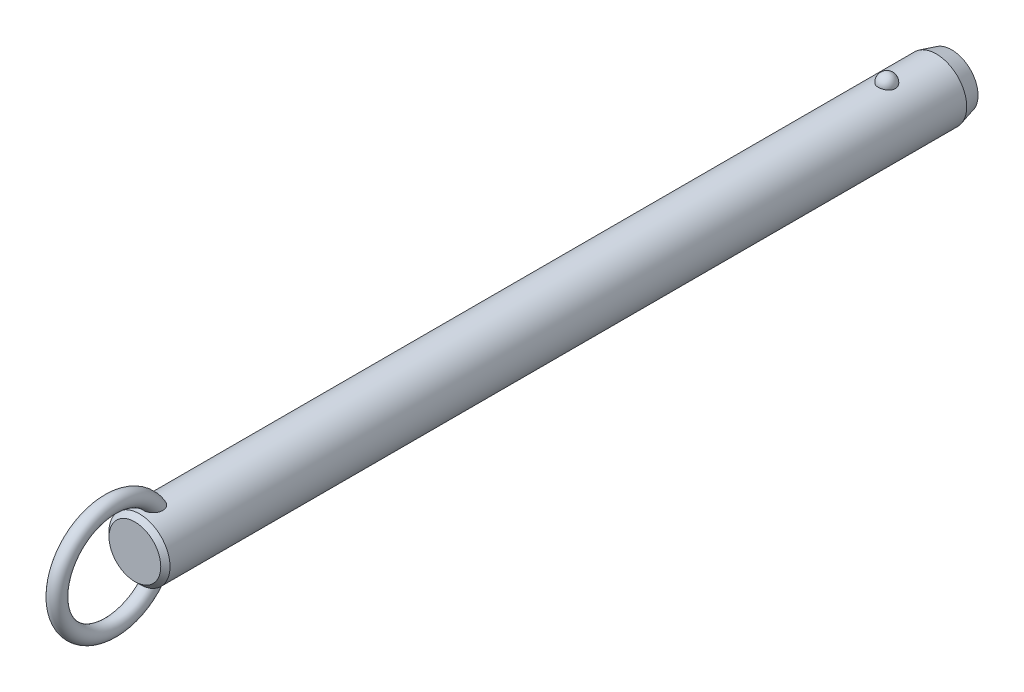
ISO-10303-21;
HEADER;
FILE_DESCRIPTION(('STEP AP214'),'2;1');
FILE_NAME('part.step','',(''),(''),'','','');
FILE_SCHEMA(('AUTOMOTIVE_DESIGN { 1 0 10303 214 1 1 1 1 }'));
ENDSEC;
DATA;
#1=APPLICATION_CONTEXT('core data for automotive mechanical design processes');
#2=APPLICATION_PROTOCOL_DEFINITION('international standard','automotive_design',2000,#1);
#3=PRODUCT_CONTEXT('',#1,'mechanical');
#4=PRODUCT('Part','Part','',(#3));
#5=PRODUCT_RELATED_PRODUCT_CATEGORY('part','',(#4));
#6=PRODUCT_DEFINITION_FORMATION('','',#4);
#7=PRODUCT_DEFINITION_CONTEXT('part definition',#1,'design');
#8=PRODUCT_DEFINITION('design','',#6,#7);
#9=PRODUCT_DEFINITION_SHAPE('','',#8);
#10=(LENGTH_UNIT() NAMED_UNIT(*) SI_UNIT(.MILLI.,.METRE.));
#11=(NAMED_UNIT(*) PLANE_ANGLE_UNIT() SI_UNIT($,.RADIAN.));
#12=(NAMED_UNIT(*) SI_UNIT($,.STERADIAN.) SOLID_ANGLE_UNIT());
#13=UNCERTAINTY_MEASURE_WITH_UNIT(LENGTH_MEASURE(1.E-05),#10,'distance_accuracy_value','');
#14=(GEOMETRIC_REPRESENTATION_CONTEXT(3) GLOBAL_UNCERTAINTY_ASSIGNED_CONTEXT((#13)) GLOBAL_UNIT_ASSIGNED_CONTEXT((#10,
#11,#12)) REPRESENTATION_CONTEXT('',''));
#15=CARTESIAN_POINT('',(0.,0.,0.));
#16=DIRECTION('',(0.,0.,1.));
#17=DIRECTION('',(1.,0.,0.));
#18=AXIS2_PLACEMENT_3D('',#15,#16,#17);
#19=CARTESIAN_POINT('',(0.,0.,182.9));
#20=DIRECTION('',(0.,0.,-1.));
#21=DIRECTION('',(-1.,0.,0.));
#22=AXIS2_PLACEMENT_3D('',#19,#20,#21);
#23=CYLINDRICAL_SURFACE('',#22,7.9);
#24=CARTESIAN_POINT('',(2.1785689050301,7.59367088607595,-2.20000000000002));
#25=CARTESIAN_POINT('',(2.17856679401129,7.59367269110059,-2.07701843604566));
#26=CARTESIAN_POINT('',(2.16853481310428,7.59657145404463,-1.95401006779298));
#27=CARTESIAN_POINT('',(2.12864689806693,7.607843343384,-1.71147811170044));
#28=CARTESIAN_POINT('',(2.09878338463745,7.61621856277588,-1.5919558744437));
#29=CARTESIAN_POINT('',(2.0199931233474,7.63749180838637,-1.35985638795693));
#30=CARTESIAN_POINT('',(1.97107475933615,7.6503878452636,-1.24727610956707));
#31=CARTESIAN_POINT('',(1.85539377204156,7.67926115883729,-1.03213234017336));
#32=CARTESIAN_POINT('',(1.78863158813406,7.69523835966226,-0.929568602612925));
#33=CARTESIAN_POINT('',(1.63856494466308,7.7285848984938,-0.73678633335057));
#34=CARTESIAN_POINT('',(1.55518140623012,7.7459606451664,-0.646630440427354));
#35=CARTESIAN_POINT('',(1.37422937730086,7.78009978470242,-0.481747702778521));
#36=CARTESIAN_POINT('',(1.27666086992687,7.79686317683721,-0.407020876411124));
#37=CARTESIAN_POINT('',(1.07024728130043,7.82786153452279,-0.275278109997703));
#38=CARTESIAN_POINT('',(0.961434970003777,7.84210353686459,-0.218212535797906));
#39=CARTESIAN_POINT('',(0.735351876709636,7.86652194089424,-0.123146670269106));
#40=CARTESIAN_POINT('',(0.618082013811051,7.87669878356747,-0.0851443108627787));
#41=CARTESIAN_POINT('',(0.380637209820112,7.89170521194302,-0.0298158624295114));
#42=CARTESIAN_POINT('',(0.260550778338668,7.89662650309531,-0.0121347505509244));
#43=CARTESIAN_POINT('',(0.0190117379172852,7.90090003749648,0.00324379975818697));
#44=CARTESIAN_POINT('',(-0.102440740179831,7.90025280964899,0.000943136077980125));
#45=CARTESIAN_POINT('',(-0.341452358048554,7.89351056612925,-0.0233955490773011));
#46=CARTESIAN_POINT('',(-0.459042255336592,7.88749257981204,-0.0451545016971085));
#47=CARTESIAN_POINT('',(-0.688796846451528,7.87075812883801,-0.107408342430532));
#48=CARTESIAN_POINT('',(-0.800961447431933,7.86004158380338,-0.14790355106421));
#49=CARTESIAN_POINT('',(-1.01743634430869,7.83497131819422,-0.246799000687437));
#50=CARTESIAN_POINT('',(-1.12169791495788,7.82059709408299,-0.305300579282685));
#51=CARTESIAN_POINT('',(-1.31891765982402,7.78976470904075,-0.43854939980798));
#52=CARTESIAN_POINT('',(-1.41187469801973,7.77330633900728,-0.513298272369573));
#53=CARTESIAN_POINT('',(-1.58577142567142,7.73972434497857,-0.678622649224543));
#54=CARTESIAN_POINT('',(-1.66645140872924,7.72259402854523,-0.769470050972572));
#55=CARTESIAN_POINT('',(-1.81161503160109,7.68983776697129,-0.963538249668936));
#56=CARTESIAN_POINT('',(-1.87609753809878,7.6742119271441,-1.0667599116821));
#57=CARTESIAN_POINT('',(-1.98790138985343,7.6460202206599,-1.28401170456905));
#58=CARTESIAN_POINT('',(-2.03501994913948,7.63349104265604,-1.39815107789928));
#59=CARTESIAN_POINT('',(-2.10986724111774,7.6131449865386,-1.6330178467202));
#60=CARTESIAN_POINT('',(-2.1375965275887,7.60532797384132,-1.75374505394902));
#61=CARTESIAN_POINT('',(-2.17289256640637,7.5953195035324,-1.99782562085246));
#62=CARTESIAN_POINT('',(-2.18054294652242,7.59310471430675,-2.12116592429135));
#63=CARTESIAN_POINT('',(-2.17572919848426,7.59448538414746,-2.36741799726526));
#64=CARTESIAN_POINT('',(-2.1632656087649,7.59808068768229,-2.49032977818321));
#65=CARTESIAN_POINT('',(-2.11865035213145,7.61064035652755,-2.73161015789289));
#66=CARTESIAN_POINT('',(-2.08659579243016,7.61957823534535,-2.84999812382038));
#67=CARTESIAN_POINT('',(-2.00367799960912,7.64179982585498,-3.07955956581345));
#68=CARTESIAN_POINT('',(-1.9528140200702,7.65508371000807,-3.19073275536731));
#69=CARTESIAN_POINT('',(-1.83321113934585,7.68460381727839,-3.40337899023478));
#70=CARTESIAN_POINT('',(-1.76437735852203,7.70085556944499,-3.5047965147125));
#71=CARTESIAN_POINT('',(-1.61069526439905,7.73445734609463,-3.69446912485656));
#72=CARTESIAN_POINT('',(-1.52584634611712,7.75180741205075,-3.78272371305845));
#73=CARTESIAN_POINT('',(-1.34198059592,7.78574608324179,-3.94393987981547));
#74=CARTESIAN_POINT('',(-1.24291308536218,7.80233167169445,-4.01684434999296));
#75=CARTESIAN_POINT('',(-1.03352039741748,7.83281625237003,-4.14489386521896));
#76=CARTESIAN_POINT('',(-0.92319600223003,7.84671543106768,-4.20004014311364));
#77=CARTESIAN_POINT('',(-0.695822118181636,7.87011575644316,-4.29042017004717));
#78=CARTESIAN_POINT('',(-0.578872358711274,7.87966903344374,-4.32589112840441));
#79=CARTESIAN_POINT('',(-0.340410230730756,7.8935652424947,-4.37692226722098));
#80=CARTESIAN_POINT('',(-0.218898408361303,7.89790879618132,-4.39248482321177));
#81=CARTESIAN_POINT('',(0.0228107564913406,7.90087453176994,-4.40314405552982));
#82=CARTESIAN_POINT('',(0.142990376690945,7.89960185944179,-4.39861683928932));
#83=CARTESIAN_POINT('',(0.380829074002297,7.89171262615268,-4.37008293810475));
#84=CARTESIAN_POINT('',(0.498488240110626,7.8850962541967,-4.34607694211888));
#85=CARTESIAN_POINT('',(0.727535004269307,7.86726442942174,-4.27939317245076));
#86=CARTESIAN_POINT('',(0.838944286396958,7.85606616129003,-4.23678512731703));
#87=CARTESIAN_POINT('',(1.05295421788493,7.83025654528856,-4.13408348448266));
#88=CARTESIAN_POINT('',(1.15555431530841,7.81564498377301,-4.07398879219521));
#89=CARTESIAN_POINT('',(1.35076763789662,7.7843022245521,-3.93687432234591));
#90=CARTESIAN_POINT('',(1.4432046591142,7.76754209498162,-3.85961036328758));
#91=CARTESIAN_POINT('',(1.6139111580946,7.73387857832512,-3.69076949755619));
#92=CARTESIAN_POINT('',(1.6921781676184,7.71697516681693,-3.59919010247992));
#93=CARTESIAN_POINT('',(1.83380875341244,7.6845643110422,-3.40247278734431));
#94=CARTESIAN_POINT('',(1.89689280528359,7.66908588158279,-3.29712873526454));
#95=CARTESIAN_POINT('',(2.0047823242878,7.64159441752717,-3.07707931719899));
#96=CARTESIAN_POINT('',(2.0495945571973,7.62958010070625,-2.96237743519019));
#97=CARTESIAN_POINT('',(2.11580183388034,7.61146617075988,-2.74040519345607));
#98=CARTESIAN_POINT('',(2.13929812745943,7.60484503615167,-2.63379846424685));
#99=CARTESIAN_POINT('',(2.17068242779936,7.59594664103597,-2.4181348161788));
#100=CARTESIAN_POINT('',(2.17857077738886,7.59366928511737,-2.30907795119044));
#101=CARTESIAN_POINT('',(2.1785689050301,7.59367088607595,-2.20000000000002));
#102=B_SPLINE_CURVE_WITH_KNOTS('',3,(#24,#25,#26,#27,#28,#29,#30,#31,#32,#33,#34,#35,#36,#37,
#38,#39,#40,#41,#42,#43,#44,#45,#46,#47,#48,#49,#50,#51,#52,#53,#54,#55,#56,#57,#58,#59,#60,#61,
#62,#63,#64,#65,#66,#67,#68,#69,#70,#71,#72,#73,#74,#75,#76,#77,#78,#79,#80,#81,#82,#83,#84,#85,
#86,#87,#88,#89,#90,#91,#92,#93,#94,#95,#96,#97,#98,#99,#100,#101),.UNSPECIFIED.,.T.,.F.,(4,2,2,
2,2,2,2,2,2,2,2,2,2,2,2,2,2,2,2,2,2,2,2,2,2,2,2,2,2,2,2,2,2,2,2,2,2,2,4),(0.,0.368552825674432,
0.737246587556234,1.10577831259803,1.4743009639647,1.8446206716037,2.21494081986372,
2.5842105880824,2.95344028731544,3.31611630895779,3.67875788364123,4.03628044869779,
4.39380913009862,4.75338791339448,5.11300280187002,5.47939989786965,5.8458226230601,
6.21639834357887,6.58696347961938,6.95598276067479,7.32499216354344,7.69218715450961,
8.0593967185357,8.42858578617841,8.79778880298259,9.16834203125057,9.5388695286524,
9.90482699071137,10.2707407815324,10.6298333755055,10.9889132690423,11.3466585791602,
11.7044262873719,12.0676511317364,12.4309391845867,12.8004764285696,13.1698767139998,
13.4967701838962,13.8236564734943),.UNSPECIFIED.);
#103=CARTESIAN_POINT('',(2.1785689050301,7.59367088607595,-2.20000000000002));
#104=VERTEX_POINT('',#103);
#105=EDGE_CURVE('E41',#104,#104,#102,.T.);
#106=ORIENTED_EDGE('',*,*,#105,.T.);
#107=EDGE_LOOP('',(#106));
#108=FACE_BOUND('',#107,.T.);
#109=CARTESIAN_POINT('',(0.,0.,191.22));
#110=DIRECTION('',(0.,0.,1.));
#111=DIRECTION('',(1.,0.,0.));
#112=AXIS2_PLACEMENT_3D('',#109,#110,#111);
#113=CIRCLE('',#112,7.9);
#114=CARTESIAN_POINT('',(7.9,0.,191.22));
#115=VERTEX_POINT('',#114);
#116=EDGE_CURVE('E10',#115,#115,#113,.F.);
#117=ORIENTED_EDGE('',*,*,#116,.T.);
#118=EDGE_LOOP('',(#117));
#119=FACE_BOUND('',#118,.T.);
#120=CARTESIAN_POINT('',(-0.630969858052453,-7.87476203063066,185.112432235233));
#121=CARTESIAN_POINT('',(-0.734180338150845,-7.86648998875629,185.147285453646));
#122=CARTESIAN_POINT('',(-0.83447695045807,-7.85639291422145,185.190816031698));
#123=CARTESIAN_POINT('',(-1.0262035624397,-7.83366343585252,185.294094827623));
#124=CARTESIAN_POINT('',(-1.1176141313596,-7.82102565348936,185.353877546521));
#125=CARTESIAN_POINT('',(-1.28877277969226,-7.79464922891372,185.487839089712));
#126=CARTESIAN_POINT('',(-1.36854014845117,-7.78091246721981,185.561993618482));
#127=CARTESIAN_POINT('',(-1.51461521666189,-7.75380398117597,185.722494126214));
#128=CARTESIAN_POINT('',(-1.58092966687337,-7.74043207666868,185.808833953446));
#129=CARTESIAN_POINT('',(-1.70019064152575,-7.7151252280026,185.992978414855));
#130=CARTESIAN_POINT('',(-1.75284037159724,-7.70322473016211,186.090979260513));
#131=CARTESIAN_POINT('',(-1.84263464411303,-7.68224112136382,186.294102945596));
#132=CARTESIAN_POINT('',(-1.87977299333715,-7.6731591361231,186.399228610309));
#133=CARTESIAN_POINT('',(-1.94152728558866,-7.65777930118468,186.623284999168));
#134=CARTESIAN_POINT('',(-1.96475471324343,-7.65179654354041,186.742616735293));
#135=CARTESIAN_POINT('',(-1.99449499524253,-7.64409642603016,186.98342986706));
#136=CARTESIAN_POINT('',(-2.0010005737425,-7.64238092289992,187.104912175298));
#137=CARTESIAN_POINT('',(-1.99856014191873,-7.64302120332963,187.368340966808));
#138=CARTESIAN_POINT('',(-1.98680021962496,-7.64611845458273,187.51025654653));
#139=CARTESIAN_POINT('',(-1.94457772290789,-7.65696186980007,187.791118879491));
#140=CARTESIAN_POINT('',(-1.91409393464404,-7.66471330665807,187.930062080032));
#141=CARTESIAN_POINT('',(-1.82768670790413,-7.68582947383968,188.231939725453));
#142=CARTESIAN_POINT('',(-1.76772963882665,-7.70003779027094,188.393686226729));
#143=CARTESIAN_POINT('',(-1.65998501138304,-7.72371550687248,188.627695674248));
#144=CARTESIAN_POINT('',(-1.62107967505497,-7.73200670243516,188.704297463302));
#145=CARTESIAN_POINT('',(-1.53727726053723,-7.7491037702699,188.854079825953));
#146=CARTESIAN_POINT('',(-1.49238215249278,-7.75790947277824,188.927261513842));
#147=CARTESIAN_POINT('',(-1.37397050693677,-7.77993338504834,189.10288382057));
#148=CARTESIAN_POINT('',(-1.29690364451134,-7.79328473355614,189.202955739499));
#149=CARTESIAN_POINT('',(-1.12885487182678,-7.81939266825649,189.390714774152));
#150=CARTESIAN_POINT('',(-1.03789926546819,-7.83215032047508,189.478424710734));
#151=CARTESIAN_POINT('',(-0.869532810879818,-7.85231710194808,189.613414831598));
#152=CARTESIAN_POINT('',(-0.795716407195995,-7.86021093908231,189.665076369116));
#153=CARTESIAN_POINT('',(-0.640813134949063,-7.87434920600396,189.756381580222));
#154=CARTESIAN_POINT('',(-0.559737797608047,-7.88059619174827,189.79604389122));
#155=CARTESIAN_POINT('',(-0.406456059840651,-7.88984116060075,189.854300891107));
#156=CARTESIAN_POINT('',(-0.335227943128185,-7.89321892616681,189.875384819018));
#157=CARTESIAN_POINT('',(-0.190193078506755,-7.89804235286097,189.90541418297));
#158=CARTESIAN_POINT('',(-0.116388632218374,-7.89948969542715,189.914370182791));
#159=CARTESIAN_POINT('',(0.0318414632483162,-7.90028409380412,189.919291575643));
#160=CARTESIAN_POINT('',(0.106268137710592,-7.89962640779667,189.915227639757));
#161=CARTESIAN_POINT('',(0.253290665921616,-7.8962818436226,189.894461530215));
#162=CARTESIAN_POINT('',(0.325885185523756,-7.8935935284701,189.877750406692));
#163=CARTESIAN_POINT('',(0.481441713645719,-7.88577340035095,189.828738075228));
#164=CARTESIAN_POINT('',(0.563611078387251,-7.88026321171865,189.794005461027));
#165=CARTESIAN_POINT('',(0.721129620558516,-7.86741729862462,189.711796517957));
#166=CARTESIAN_POINT('',(0.79646633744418,-7.86007832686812,189.664297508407));
#167=CARTESIAN_POINT('',(0.971456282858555,-7.84073285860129,189.536513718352));
#168=CARTESIAN_POINT('',(1.06719686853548,-7.82809461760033,189.451004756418));
#169=CARTESIAN_POINT('',(1.24418921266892,-7.80192439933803,189.266232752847));
#170=CARTESIAN_POINT('',(1.32540832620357,-7.78839049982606,189.166939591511));
#171=CARTESIAN_POINT('',(1.45199971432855,-7.76559693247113,188.989576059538));
#172=CARTESIAN_POINT('',(1.50085649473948,-7.75626094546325,188.913954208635));
#173=CARTESIAN_POINT('',(1.59197749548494,-7.73807279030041,188.758742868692));
#174=CARTESIAN_POINT('',(1.63423919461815,-7.72922080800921,188.679151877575));
#175=CARTESIAN_POINT('',(1.71222612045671,-7.71231959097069,188.516664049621));
#176=CARTESIAN_POINT('',(1.74794516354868,-7.70427111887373,188.433764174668));
#177=CARTESIAN_POINT('',(1.81270113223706,-7.68929240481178,188.265296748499));
#178=CARTESIAN_POINT('',(1.84173789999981,-7.68236218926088,188.179729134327));
#179=CARTESIAN_POINT('',(1.89322698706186,-7.6698375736,188.00528702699));
#180=CARTESIAN_POINT('',(1.91558744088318,-7.66426199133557,187.916383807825));
#181=CARTESIAN_POINT('',(1.95281367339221,-7.65485915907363,187.736969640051));
#182=CARTESIAN_POINT('',(1.96767946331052,-7.65103190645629,187.646458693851));
#183=CARTESIAN_POINT('',(2.0002145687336,-7.64262981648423,187.373732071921));
#184=CARTESIAN_POINT('',(2.00600691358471,-7.6410871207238,187.189709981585));
#185=CARTESIAN_POINT('',(1.98445334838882,-7.64669564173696,186.876501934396));
#186=CARTESIAN_POINT('',(1.96607186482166,-7.65149688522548,186.746618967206));
#187=CARTESIAN_POINT('',(1.90884967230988,-7.66597624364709,186.491632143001));
#188=CARTESIAN_POINT('',(1.87002101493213,-7.67565148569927,186.366525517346));
#189=CARTESIAN_POINT('',(1.77063986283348,-7.69918471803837,186.12454013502));
#190=CARTESIAN_POINT('',(1.70993724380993,-7.71307150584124,186.007725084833));
#191=CARTESIAN_POINT('',(1.56733070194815,-7.74330306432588,185.788144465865));
#192=CARTESIAN_POINT('',(1.48543692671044,-7.75964665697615,185.685372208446));
#193=CARTESIAN_POINT('',(1.31346177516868,-7.79047523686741,185.509380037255));
#194=CARTESIAN_POINT('',(1.22547278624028,-7.80495298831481,185.434106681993));
#195=CARTESIAN_POINT('',(1.03724352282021,-7.83218597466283,185.300486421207));
#196=CARTESIAN_POINT('',(0.937008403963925,-7.84494192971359,185.242132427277));
#197=CARTESIAN_POINT('',(0.733599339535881,-7.86649045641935,185.147027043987));
#198=CARTESIAN_POINT('',(0.630941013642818,-7.87547134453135,185.109210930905));
#199=CARTESIAN_POINT('',(0.420465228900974,-7.88950708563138,185.051116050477));
#200=CARTESIAN_POINT('',(0.31264590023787,-7.89456050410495,185.03084369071));
#201=CARTESIAN_POINT('',(0.096086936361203,-7.9001518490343,185.008455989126));
#202=CARTESIAN_POINT('',(-0.0126341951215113,-7.90073226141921,185.006169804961));
#203=CARTESIAN_POINT('',(-0.228766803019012,-7.89742350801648,185.019367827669));
#204=CARTESIAN_POINT('',(-0.336180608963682,-7.89354403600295,185.034813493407));
#205=CARTESIAN_POINT('',(-0.473410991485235,-7.88586871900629,185.066217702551));
#206=CARTESIAN_POINT('',(-0.50525779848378,-7.88388984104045,185.074354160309));
#207=CARTESIAN_POINT('',(-0.56848128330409,-7.87958326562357,185.092208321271));
#208=CARTESIAN_POINT('',(-0.59985795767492,-7.87725556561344,185.101926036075));
#209=CARTESIAN_POINT('',(-0.630969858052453,-7.87476203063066,185.112432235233));
#210=B_SPLINE_CURVE_WITH_KNOTS('',3,(#120,#121,#122,#123,#124,#125,#126,#127,#128,#129,#130,
#131,#132,#133,#134,#135,#136,#137,#138,#139,#140,#141,#142,#143,#144,#145,#146,#147,#148,#149,
#150,#151,#152,#153,#154,#155,#156,#157,#158,#159,#160,#161,#162,#163,#164,#165,#166,#167,#168,
#169,#170,#171,#172,#173,#174,#175,#176,#177,#178,#179,#180,#181,#182,#183,#184,#185,#186,#187,
#188,#189,#190,#191,#192,#193,#194,#195,#196,#197,#198,#199,#200,#201,#202,#203,#204,#205,#206,
#207,#208,#209),.UNSPECIFIED.,.T.,.F.,(4,2,2,2,2,2,2,2,2,2,2,2,2,2,2,2,2,2,2,2,2,2,2,2,2,2,2,2,
2,2,2,2,2,2,2,2,2,2,2,2,2,2,2,2,4),(0.,0.327622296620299,0.655945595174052,0.983718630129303,
1.3113267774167,1.64554655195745,1.97989964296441,2.34365728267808,2.70757317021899,
3.13333684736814,3.5595838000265,4.07655306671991,4.33527897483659,4.59391999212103,
4.97382437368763,5.353017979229,5.62348245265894,5.89352465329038,6.11565959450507,
6.33760092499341,6.56004255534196,6.78264174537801,7.04930844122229,7.31645206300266,
7.70130871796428,8.08701995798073,8.35824509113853,8.6295736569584,8.9011573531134,
9.1727474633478,9.44791855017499,9.72308922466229,10.2715298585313,10.6638393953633,
11.0559179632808,11.4507403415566,11.8453740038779,12.1936425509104,12.5417649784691,
12.8695063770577,13.1973674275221,13.5221104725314,13.8461490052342,13.9449071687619,
14.0436660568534),.UNSPECIFIED.);
#211=CARTESIAN_POINT('',(-0.630969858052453,-7.87476203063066,185.112432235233));
#212=VERTEX_POINT('',#211);
#213=EDGE_CURVE('E60',#212,#212,#210,.T.);
#214=ORIENTED_EDGE('',*,*,#213,.T.);
#215=EDGE_LOOP('',(#214));
#216=FACE_BOUND('',#215,.T.);
#217=CARTESIAN_POINT('',(-0.630969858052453,7.87476203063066,185.112432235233));
#218=CARTESIAN_POINT('',(-0.528918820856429,7.88293636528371,185.077979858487));
#219=CARTESIAN_POINT('',(-0.423745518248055,7.88934810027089,185.051915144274));
#220=CARTESIAN_POINT('',(-0.210236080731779,7.8979273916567,185.017282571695));
#221=CARTESIAN_POINT('',(-0.10189380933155,7.90008607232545,185.008751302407));
#222=CARTESIAN_POINT('',(0.11466056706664,7.89990877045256,185.009457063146));
#223=CARTESIAN_POINT('',(0.222872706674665,7.89757640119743,185.01867980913));
#224=CARTESIAN_POINT('',(0.436107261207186,7.88867538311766,185.054652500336));
#225=CARTESIAN_POINT('',(0.54113114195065,7.8821087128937,185.08139425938));
#226=CARTESIAN_POINT('',(0.745085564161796,7.86545130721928,185.151756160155));
#227=CARTESIAN_POINT('',(0.844015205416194,7.85536005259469,185.195378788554));
#228=CARTESIAN_POINT('',(1.03299167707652,7.83275153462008,185.298379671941));
#229=CARTESIAN_POINT('',(1.12303841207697,7.8202342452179,185.357758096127));
#230=CARTESIAN_POINT('',(1.29214734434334,7.79408219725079,185.490864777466));
#231=CARTESIAN_POINT('',(1.37116907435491,7.78044359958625,185.564643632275));
#232=CARTESIAN_POINT('',(1.51597677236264,7.75353170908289,185.724235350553));
#233=CARTESIAN_POINT('',(1.58176261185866,7.74025841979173,185.810048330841));
#234=CARTESIAN_POINT('',(1.70057386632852,7.71504069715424,185.993644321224));
#235=CARTESIAN_POINT('',(1.75320073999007,7.7031425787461,186.091690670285));
#236=CARTESIAN_POINT('',(1.8429376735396,7.68216822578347,186.294893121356));
#237=CARTESIAN_POINT('',(1.88004278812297,7.67309289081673,186.400051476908));
#238=CARTESIAN_POINT('',(1.9417232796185,7.6577294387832,186.624167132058));
#239=CARTESIAN_POINT('',(1.96491037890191,7.65175648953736,186.743524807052));
#240=CARTESIAN_POINT('',(1.9945689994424,7.64407702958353,186.984384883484));
#241=CARTESIAN_POINT('',(2.00103304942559,7.64237242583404,187.10588821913));
#242=CARTESIAN_POINT('',(1.99850166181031,7.64303650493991,187.369368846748));
#243=CARTESIAN_POINT('',(1.98669038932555,7.64614714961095,187.511314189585));
#244=CARTESIAN_POINT('',(1.94436120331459,7.65701701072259,187.792228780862));
#245=CARTESIAN_POINT('',(1.91382203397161,7.66478150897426,187.931194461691));
#246=CARTESIAN_POINT('',(1.82728754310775,7.68592483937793,188.233111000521));
#247=CARTESIAN_POINT('',(1.76725778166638,7.70014685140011,188.394872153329));
#248=CARTESIAN_POINT('',(1.65939700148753,7.72384204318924,188.628891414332));
#249=CARTESIAN_POINT('',(1.62045187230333,7.73213852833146,188.705494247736));
#250=CARTESIAN_POINT('',(1.5365668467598,7.74924489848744,188.855273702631));
#251=CARTESIAN_POINT('',(1.49162892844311,7.75805461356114,188.928451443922));
#252=CARTESIAN_POINT('',(1.37317698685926,7.78007342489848,189.103952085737));
#253=CARTESIAN_POINT('',(1.29612360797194,7.79341423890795,189.203911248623));
#254=CARTESIAN_POINT('',(1.12812043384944,7.81949839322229,189.39145083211));
#255=CARTESIAN_POINT('',(1.03719688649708,7.83224280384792,189.479054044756));
#256=CARTESIAN_POINT('',(0.868871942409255,7.85239026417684,189.61389715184));
#257=CARTESIAN_POINT('',(0.795056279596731,7.86027769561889,189.665511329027));
#258=CARTESIAN_POINT('',(0.640160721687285,7.87440222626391,189.756720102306));
#259=CARTESIAN_POINT('',(0.559092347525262,7.88064188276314,189.796333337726));
#260=CARTESIAN_POINT('',(0.405820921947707,7.8898738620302,189.854505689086));
#261=CARTESIAN_POINT('',(0.334594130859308,7.89324577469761,189.875552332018));
#262=CARTESIAN_POINT('',(0.189568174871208,7.89805733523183,189.905507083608));
#263=CARTESIAN_POINT('',(0.115771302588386,7.89949866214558,189.914425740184));
#264=CARTESIAN_POINT('',(-0.0324359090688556,7.90028156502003,189.91927589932));
#265=CARTESIAN_POINT('',(-0.106847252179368,7.89961843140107,189.915178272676));
#266=CARTESIAN_POINT('',(-0.253834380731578,7.8962642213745,189.894351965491));
#267=CARTESIAN_POINT('',(-0.326408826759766,7.89357170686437,189.877614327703));
#268=CARTESIAN_POINT('',(-0.481962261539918,7.88574179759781,189.828539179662));
#269=CARTESIAN_POINT('',(-0.564145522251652,7.88022507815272,189.793763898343));
#270=CARTESIAN_POINT('',(-0.721685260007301,7.86736646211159,189.711468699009));
#271=CARTESIAN_POINT('',(-0.79702924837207,7.8600213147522,189.663926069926));
#272=CARTESIAN_POINT('',(-0.972044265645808,7.84066026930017,189.536026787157));
#273=CARTESIAN_POINT('',(-1.06779803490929,7.828012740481,189.450443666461));
#274=CARTESIAN_POINT('',(-1.24480531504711,7.80182621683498,189.265522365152));
#275=CARTESIAN_POINT('',(-1.32602618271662,7.78828530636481,189.166154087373));
#276=CARTESIAN_POINT('',(-1.4525983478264,7.76548487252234,188.988680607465));
#277=CARTESIAN_POINT('',(-1.50143856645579,7.75614818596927,188.913025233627));
#278=CARTESIAN_POINT('',(-1.59252410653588,7.73796020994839,188.757748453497));
#279=CARTESIAN_POINT('',(-1.63476690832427,7.729109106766,188.678125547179));
#280=CARTESIAN_POINT('',(-1.71271318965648,7.71221133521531,188.515575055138));
#281=CARTESIAN_POINT('',(-1.74841047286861,7.70416543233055,188.432644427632));
#282=CARTESIAN_POINT('',(-1.81311929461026,7.6891937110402,188.264116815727));
#283=CARTESIAN_POINT('',(-1.84213067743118,7.68226791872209,188.178519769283));
#284=CARTESIAN_POINT('',(-1.89356259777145,7.66975461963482,188.004025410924));
#285=CARTESIAN_POINT('',(-1.91589165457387,7.66418586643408,187.915099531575));
#286=CARTESIAN_POINT('',(-1.9530507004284,7.65479859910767,187.735642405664));
#287=CARTESIAN_POINT('',(-1.96788069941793,7.65098008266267,187.645111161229));
#288=CARTESIAN_POINT('',(-2.00030078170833,7.64260704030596,187.372327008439));
#289=CARTESIAN_POINT('',(-2.00600576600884,7.64108760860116,187.188271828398));
#290=CARTESIAN_POINT('',(-1.9842848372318,7.64673945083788,186.875080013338));
#291=CARTESIAN_POINT('',(-1.96583698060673,7.65155751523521,186.745240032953));
#292=CARTESIAN_POINT('',(-1.90848948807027,7.66606613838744,186.490361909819));
#293=CARTESIAN_POINT('',(-1.86960376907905,7.67575338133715,186.365320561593));
#294=CARTESIAN_POINT('',(-1.77013421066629,7.6993013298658,186.123500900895));
#295=CARTESIAN_POINT('',(-1.70940488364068,7.71318991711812,186.006784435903));
#296=CARTESIAN_POINT('',(-1.56672953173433,7.74342495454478,185.787340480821));
#297=CARTESIAN_POINT('',(-1.48478316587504,7.75977144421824,185.68461321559));
#298=CARTESIAN_POINT('',(-1.31266325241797,7.79061163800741,185.508643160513));
#299=CARTESIAN_POINT('',(-1.22456383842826,7.80509908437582,185.433358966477));
#300=CARTESIAN_POINT('',(-1.03622400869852,7.83231881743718,185.299865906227));
#301=CARTESIAN_POINT('',(-0.936015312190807,7.84505551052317,185.241613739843));
#302=CARTESIAN_POINT('',(-0.798824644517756,7.85957802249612,185.177540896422));
#303=CARTESIAN_POINT('',(-0.765787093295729,7.86286821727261,185.163224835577));
#304=CARTESIAN_POINT('',(-0.698939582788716,7.86909211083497,185.136436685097));
#305=CARTESIAN_POINT('',(-0.66512963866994,7.8720258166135,185.123964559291));
#306=CARTESIAN_POINT('',(-0.630969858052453,7.87476203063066,185.112432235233));
#307=B_SPLINE_CURVE_WITH_KNOTS('',3,(#217,#218,#219,#220,#221,#222,#223,#224,#225,#226,#227,
#228,#229,#230,#231,#232,#233,#234,#235,#236,#237,#238,#239,#240,#241,#242,#243,#244,#245,#246,
#247,#248,#249,#250,#251,#252,#253,#254,#255,#256,#257,#258,#259,#260,#261,#262,#263,#264,#265,
#266,#267,#268,#269,#270,#271,#272,#273,#274,#275,#276,#277,#278,#279,#280,#281,#282,#283,#284,
#285,#286,#287,#288,#289,#290,#291,#292,#293,#294,#295,#296,#297,#298,#299,#300,#301,#302,#303,
#304,#305,#306),.UNSPECIFIED.,.T.,.F.,(4,2,2,2,2,2,2,2,2,2,2,2,2,2,2,2,2,2,2,2,2,2,2,2,2,2,2,2,
2,2,2,2,2,2,2,2,2,2,2,2,2,2,2,2,4),(0.,0.323920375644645,0.648516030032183,0.972850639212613,
1.29703380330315,1.62126473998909,1.94549915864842,2.27089401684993,2.5962920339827,
2.93059633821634,3.26500707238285,3.6288164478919,3.99278833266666,4.4186542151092,
4.84500434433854,5.36209210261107,5.62087589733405,5.87957448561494,6.25918598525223,
6.63808782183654,6.90846748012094,7.17842501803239,7.40052350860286,7.6224287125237,
7.84483086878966,8.06739077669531,8.33414615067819,8.60137921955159,8.98641454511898,
9.37230415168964,9.64358673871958,9.91497268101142,10.1866142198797,10.4582620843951,
10.7334745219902,11.008686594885,11.5572126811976,11.9494246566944,12.3413699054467,
12.7359755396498,13.1305875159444,13.4791770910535,13.82687259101,13.9353013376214,
14.0437279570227),.UNSPECIFIED.);
#308=CARTESIAN_POINT('',(-0.630969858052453,7.87476203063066,185.112432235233));
#309=VERTEX_POINT('',#308);
#310=EDGE_CURVE('E68',#309,#309,#307,.T.);
#311=ORIENTED_EDGE('',*,*,#310,.T.);
#312=EDGE_LOOP('',(#311));
#313=FACE_BOUND('',#312,.T.);
#314=CARTESIAN_POINT('',(0.,0.,-14.9999999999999));
#315=DIRECTION('',(0.,0.,-1.));
#316=DIRECTION('',(-1.,0.,0.));
#317=AXIS2_PLACEMENT_3D('',#314,#315,#316);
#318=CIRCLE('',#317,7.9);
#319=CARTESIAN_POINT('',(-7.9,0.,-14.9999999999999));
#320=VERTEX_POINT('',#319);
#321=EDGE_CURVE('E57',#320,#320,#318,.F.);
#322=ORIENTED_EDGE('',*,*,#321,.T.);
#323=EDGE_LOOP('',(#322));
#324=FACE_BOUND('',#323,.T.);
#325=ADVANCED_FACE('F37',(#108,#119,#216,#313,#324),#23,.T.);
#326=CARTESIAN_POINT('',(0.,0.,-19.));
#327=DIRECTION('',(0.,0.,-1.));
#328=DIRECTION('',(-1.,0.,0.));
#329=AXIS2_PLACEMENT_3D('',#326,#327,#328);
#330=PLANE('',#329);
#331=CARTESIAN_POINT('',(0.,0.,-19.));
#332=DIRECTION('',(0.,0.,-1.));
#333=DIRECTION('',(-1.,0.,0.));
#334=AXIS2_PLACEMENT_3D('',#331,#332,#333);
#335=CIRCLE('',#334,6.8282032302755);
#336=CARTESIAN_POINT('',(-6.8282032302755,0.,-19.));
#337=VERTEX_POINT('',#336);
#338=EDGE_CURVE('E67',#337,#337,#335,.T.);
#339=ORIENTED_EDGE('',*,*,#338,.T.);
#340=EDGE_LOOP('',(#339));
#341=FACE_BOUND('',#340,.T.);
#342=ADVANCED_FACE('F86',(#341),#330,.T.);
#343=CARTESIAN_POINT('',(0.,0.,-19.));
#344=DIRECTION('',(0.,0.,1.));
#345=DIRECTION('',(1.,0.,0.));
#346=AXIS2_PLACEMENT_3D('',#343,#344,#345);
#347=CONICAL_SURFACE('',#346,6.8282032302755,0.261799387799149);
#348=ORIENTED_EDGE('',*,*,#321,.F.);
#349=EDGE_LOOP('',(#348));
#350=FACE_BOUND('',#349,.T.);
#351=ORIENTED_EDGE('',*,*,#338,.F.);
#352=EDGE_LOOP('',(#351));
#353=FACE_BOUND('',#352,.T.);
#354=ADVANCED_FACE('F84',(#350,#353),#347,.T.);
#355=CARTESIAN_POINT('',(0.,0.,192.42));
#356=DIRECTION('',(0.,0.,1.));
#357=DIRECTION('',(1.,0.,0.));
#358=AXIS2_PLACEMENT_3D('',#355,#356,#357);
#359=PLANE('',#358);
#360=CARTESIAN_POINT('',(0.,0.,192.42));
#361=DIRECTION('',(0.,0.,1.));
#362=DIRECTION('',(1.,0.,0.));
#363=AXIS2_PLACEMENT_3D('',#360,#361,#362);
#364=CIRCLE('',#363,6.69999999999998);
#365=CARTESIAN_POINT('',(6.69999999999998,0.,192.42));
#366=VERTEX_POINT('',#365);
#367=EDGE_CURVE('E50',#366,#366,#364,.T.);
#368=ORIENTED_EDGE('',*,*,#367,.T.);
#369=EDGE_LOOP('',(#368));
#370=FACE_BOUND('',#369,.T.);
#371=ADVANCED_FACE('F78',(#370),#359,.T.);
#372=CARTESIAN_POINT('',(0.,0.,198.75));
#373=DIRECTION('',(1.,0.,0.));
#374=DIRECTION('',(0.,0.,-1.));
#375=AXIS2_PLACEMENT_3D('',#372,#373,#374);
#376=TOROIDAL_SURFACE('',#375,13.85,2.);
#377=ORIENTED_EDGE('',*,*,#310,.F.);
#378=EDGE_LOOP('',(#377));
#379=FACE_BOUND('',#378,.T.);
#380=ORIENTED_EDGE('',*,*,#213,.F.);
#381=EDGE_LOOP('',(#380));
#382=FACE_BOUND('',#381,.T.);
#383=ADVANCED_FACE('F74',(#379,#382),#376,.T.);
#384=CARTESIAN_POINT('',(0.,0.,192.42));
#385=DIRECTION('',(0.,0.,-1.));
#386=DIRECTION('',(-1.,0.,0.));
#387=AXIS2_PLACEMENT_3D('',#384,#385,#386);
#388=CONICAL_SURFACE('',#387,6.69999999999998,0.785398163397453);
#389=ORIENTED_EDGE('',*,*,#116,.F.);
#390=EDGE_LOOP('',(#389));
#391=FACE_BOUND('',#390,.T.);
#392=ORIENTED_EDGE('',*,*,#367,.F.);
#393=EDGE_LOOP('',(#392));
#394=FACE_BOUND('',#393,.T.);
#395=ADVANCED_FACE('F39',(#391,#394),#388,.T.);
#396=CARTESIAN_POINT('',(0.,7.9,-2.20000000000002));
#397=DIRECTION('',(0.,1.,0.));
#398=DIRECTION('',(0.,0.,-1.));
#399=AXIS2_PLACEMENT_3D('',#396,#397,#398);
#400=SPHERICAL_SURFACE('',#399,2.2);
#401=ORIENTED_EDGE('',*,*,#105,.F.);
#402=EDGE_LOOP('',(#401));
#403=FACE_BOUND('',#402,.T.);
#404=ADVANCED_FACE('F80',(#403),#400,.T.);
#405=CLOSED_SHELL('',(#325,#342,#354,#371,#383,#395,#404));
#406=MANIFOLD_SOLID_BREP('B2',#405);
#407=ADVANCED_BREP_SHAPE_REPRESENTATION('',(#18,#406),#14);
#408=SHAPE_DEFINITION_REPRESENTATION(#9,#407);
ENDSEC;
END-ISO-10303-21;
